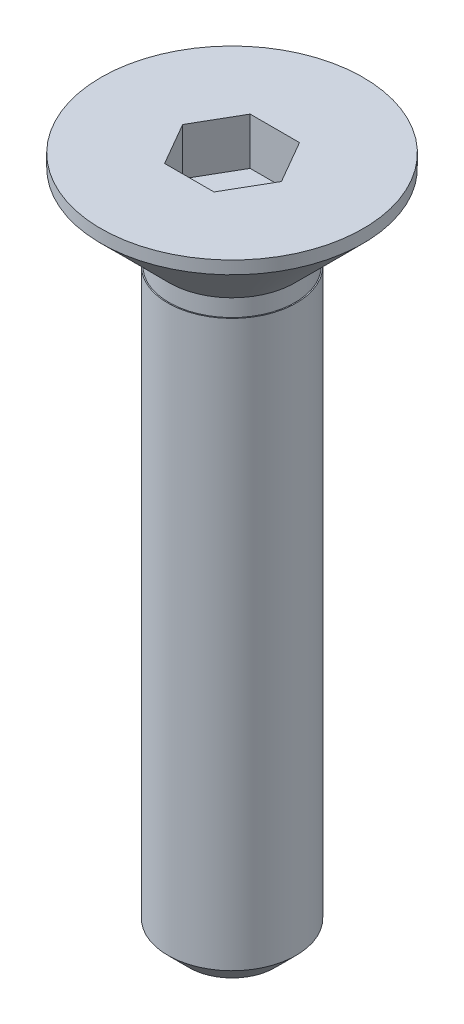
from build123d import *

# Parameters (mm, degrees)
ENL_V_MAT_EXTRU_1_DEPTH = 1.1


with BuildPart() as part:
    # Esquisse1 → R_volution1 (revolve)
    with BuildSketch(Plane.XY, mode=Mode.PRIVATE) as r_volution1_sk:
        Polygon((0, 0), (0, -13.71), (1, -13.71), (1.5, -13.21), (1.5, 0), (1.475, 0), (1.475, 0.4), (3.065, 1.99), (3.065, 2.29), (0, 2.29), align=None)
    revolve(r_volution1_sk.sketch.rotate(Axis((0, 2.29, 0), (0, -1, 0)), 180), axis=Axis((0, 2.29, 0), (0, -1, 0)))

    # Esquisse2 → Enl_v. mat.-Extru.1 (cut)
    with BuildSketch(Plane(origin=(0, 2.29, 0), x_dir=(1, 0, 0), z_dir=(0, 1, 0))):
        Polygon((0.577350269, -1), (1.154700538, 0), (0.577350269, 1), (-0.577350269, 1), (-1.154700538, 0), (-0.577350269, -1), align=None)
    extrude(amount=-ENL_V_MAT_EXTRU_1_DEPTH, mode=Mode.SUBTRACT)


solid = part.part
